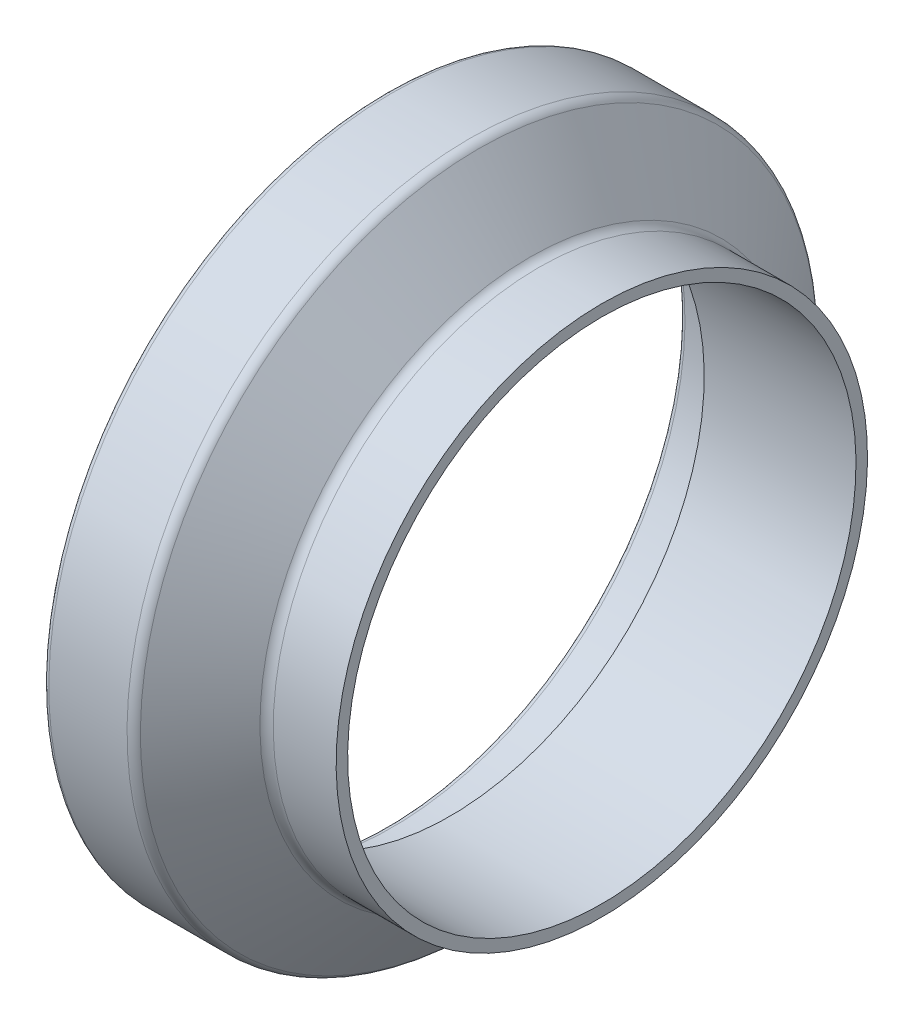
from build123d import *


with BuildPart() as part:
    # Sketch1 → Revolve1 (revolve)
    with BuildSketch(Plane.XY):
        with BuildLine():
            Line((-4.826983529, 36.449), (-26.594783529, 36.449))
            Line((-26.594783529, 36.449), (-26.594783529, 41.2623))
            ThreePointArc((-26.594783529, 41.2623), (-26.832847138, 41.837036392), (-27.407583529, 42.0751))
            Line((-27.407583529, 42.0751), (-34.976783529, 42.0751))
            ThreePointArc((-34.976783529, 42.0751), (-35.551519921, 42.313163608), (-35.789583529, 42.8879))
            Line((-35.789583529, 42.8879), (-35.789583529, 48.3362))
            ThreePointArc((-35.789583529, 48.3362), (-35.551519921, 48.910936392), (-34.976783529, 49.149))
            Line((-34.976783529, 49.149), (-23.760413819, 49.149))
            ThreePointArc((-23.760413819, 49.149), (-23.046408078, 48.980873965), (-22.482437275, 48.5118244))
            Line((-22.482437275, 48.5118244), (-15.116711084, 38.7371756))
            ThreePointArc((-15.116711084, 38.7371756), (-14.552740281, 38.268126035), (-13.838734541, 38.1))
            Line((-13.838734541, 38.1), (-4.826983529, 38.1))
            Line((-4.826983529, 38.1), (-4.826983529, 36.449))
        make_face()
    revolve(axis=Axis((0, 0, 0), (-1, 0, 0)))


solid = part.part
